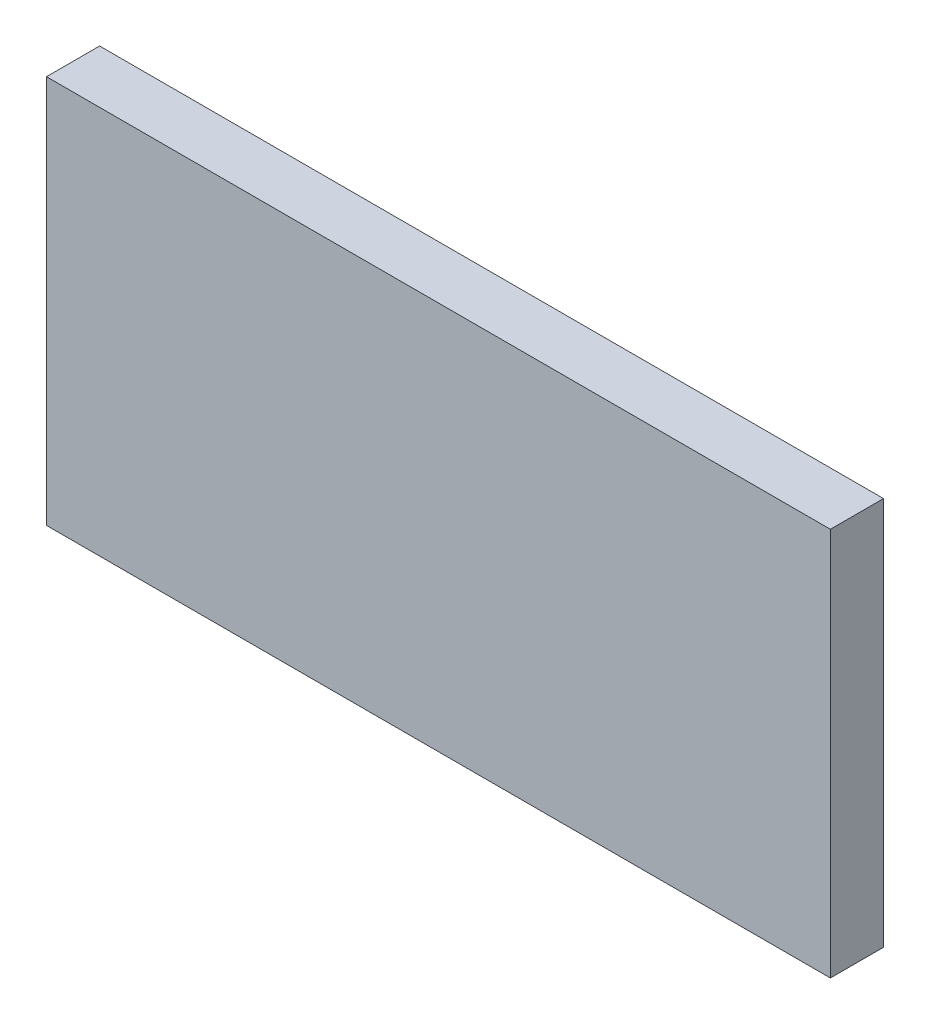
ISO-10303-21;
HEADER;
FILE_DESCRIPTION(('STEP AP214'),'2;1');
FILE_NAME('part.step','',(''),(''),'','','');
FILE_SCHEMA(('AUTOMOTIVE_DESIGN { 1 0 10303 214 1 1 1 1 }'));
ENDSEC;
DATA;
#1=APPLICATION_CONTEXT('core data for automotive mechanical design processes');
#2=APPLICATION_PROTOCOL_DEFINITION('international standard','automotive_design',2000,#1);
#3=PRODUCT_CONTEXT('',#1,'mechanical');
#4=PRODUCT('Part','Part','',(#3));
#5=PRODUCT_RELATED_PRODUCT_CATEGORY('part','',(#4));
#6=PRODUCT_DEFINITION_FORMATION('','',#4);
#7=PRODUCT_DEFINITION_CONTEXT('part definition',#1,'design');
#8=PRODUCT_DEFINITION('design','',#6,#7);
#9=PRODUCT_DEFINITION_SHAPE('','',#8);
#10=(LENGTH_UNIT() NAMED_UNIT(*) SI_UNIT(.MILLI.,.METRE.));
#11=(NAMED_UNIT(*) PLANE_ANGLE_UNIT() SI_UNIT($,.RADIAN.));
#12=(NAMED_UNIT(*) SI_UNIT($,.STERADIAN.) SOLID_ANGLE_UNIT());
#13=UNCERTAINTY_MEASURE_WITH_UNIT(LENGTH_MEASURE(1.E-05),#10,'distance_accuracy_value','');
#14=(GEOMETRIC_REPRESENTATION_CONTEXT(3) GLOBAL_UNCERTAINTY_ASSIGNED_CONTEXT((#13)) GLOBAL_UNIT_ASSIGNED_CONTEXT((#10,
#11,#12)) REPRESENTATION_CONTEXT('',''));
#15=CARTESIAN_POINT('',(0.,0.,0.));
#16=DIRECTION('',(0.,0.,1.));
#17=DIRECTION('',(1.,0.,0.));
#18=AXIS2_PLACEMENT_3D('',#15,#16,#17);
#19=CARTESIAN_POINT('',(0.,0.,4.064));
#20=DIRECTION('',(1.,0.,0.));
#21=DIRECTION('',(0.,0.,-1.));
#22=AXIS2_PLACEMENT_3D('',#19,#20,#21);
#23=PLANE('',#22);
#24=DIRECTION('',(0.,-1.,0.));
#25=VECTOR('',#24,1.);
#26=CARTESIAN_POINT('',(0.,0.,0.));
#27=LINE('',#26,#25);
#28=CARTESIAN_POINT('',(0.,29.718,0.));
#29=VERTEX_POINT('',#28);
#30=CARTESIAN_POINT('',(0.,0.,0.));
#31=VERTEX_POINT('',#30);
#32=EDGE_CURVE('E102',#29,#31,#27,.T.);
#33=ORIENTED_EDGE('',*,*,#32,.T.);
#34=DIRECTION('',(0.,0.,-1.));
#35=VECTOR('',#34,1.);
#36=CARTESIAN_POINT('',(0.,0.,4.064));
#37=LINE('',#36,#35);
#38=CARTESIAN_POINT('',(0.,0.,4.064));
#39=VERTEX_POINT('',#38);
#40=EDGE_CURVE('E11',#39,#31,#37,.T.);
#41=ORIENTED_EDGE('',*,*,#40,.F.);
#42=DIRECTION('',(0.,-1.,0.));
#43=VECTOR('',#42,1.);
#44=CARTESIAN_POINT('',(0.,0.,4.064));
#45=LINE('',#44,#43);
#46=CARTESIAN_POINT('',(0.,29.718,4.064));
#47=VERTEX_POINT('',#46);
#48=EDGE_CURVE('E90',#47,#39,#45,.T.);
#49=ORIENTED_EDGE('',*,*,#48,.F.);
#50=DIRECTION('',(0.,0.,-1.));
#51=VECTOR('',#50,1.);
#52=CARTESIAN_POINT('',(0.,29.718,4.064));
#53=LINE('',#52,#51);
#54=EDGE_CURVE('E98',#47,#29,#53,.T.);
#55=ORIENTED_EDGE('',*,*,#54,.T.);
#56=EDGE_LOOP('',(#33,#41,#49,#55));
#57=FACE_BOUND('',#56,.T.);
#58=ADVANCED_FACE('F39',(#57),#23,.F.);
#59=CARTESIAN_POINT('',(0.,0.,4.064));
#60=DIRECTION('',(0.,1.,0.));
#61=DIRECTION('',(0.,0.,1.));
#62=AXIS2_PLACEMENT_3D('',#59,#60,#61);
#63=PLANE('',#62);
#64=DIRECTION('',(1.,0.,0.));
#65=VECTOR('',#64,1.);
#66=CARTESIAN_POINT('',(0.,0.,0.));
#67=LINE('',#66,#65);
#68=CARTESIAN_POINT('',(59.944,0.,0.));
#69=VERTEX_POINT('',#68);
#70=EDGE_CURVE('E94',#31,#69,#67,.T.);
#71=ORIENTED_EDGE('',*,*,#70,.T.);
#72=DIRECTION('',(0.,0.,-1.));
#73=VECTOR('',#72,1.);
#74=CARTESIAN_POINT('',(59.944,0.,4.064));
#75=LINE('',#74,#73);
#76=CARTESIAN_POINT('',(59.944,0.,4.064));
#77=VERTEX_POINT('',#76);
#78=EDGE_CURVE('E47',#77,#69,#75,.T.);
#79=ORIENTED_EDGE('',*,*,#78,.F.);
#80=DIRECTION('',(1.,0.,0.));
#81=VECTOR('',#80,1.);
#82=CARTESIAN_POINT('',(0.,0.,4.064));
#83=LINE('',#82,#81);
#84=EDGE_CURVE('E85',#39,#77,#83,.T.);
#85=ORIENTED_EDGE('',*,*,#84,.F.);
#86=ORIENTED_EDGE('',*,*,#40,.T.);
#87=EDGE_LOOP('',(#71,#79,#85,#86));
#88=FACE_BOUND('',#87,.T.);
#89=ADVANCED_FACE('F93',(#88),#63,.F.);
#90=CARTESIAN_POINT('',(59.944,0.,4.064));
#91=DIRECTION('',(-1.,0.,0.));
#92=DIRECTION('',(0.,0.,1.));
#93=AXIS2_PLACEMENT_3D('',#90,#91,#92);
#94=PLANE('',#93);
#95=DIRECTION('',(0.,1.,0.));
#96=VECTOR('',#95,1.);
#97=CARTESIAN_POINT('',(59.944,0.,0.));
#98=LINE('',#97,#96);
#99=CARTESIAN_POINT('',(59.944,29.718,0.));
#100=VERTEX_POINT('',#99);
#101=EDGE_CURVE('E72',#69,#100,#98,.T.);
#102=ORIENTED_EDGE('',*,*,#101,.T.);
#103=DIRECTION('',(0.,0.,-1.));
#104=VECTOR('',#103,1.);
#105=CARTESIAN_POINT('',(59.944,29.718,4.064));
#106=LINE('',#105,#104);
#107=CARTESIAN_POINT('',(59.944,29.718,4.064));
#108=VERTEX_POINT('',#107);
#109=EDGE_CURVE('E95',#108,#100,#106,.T.);
#110=ORIENTED_EDGE('',*,*,#109,.F.);
#111=DIRECTION('',(0.,1.,0.));
#112=VECTOR('',#111,1.);
#113=CARTESIAN_POINT('',(59.944,0.,4.064));
#114=LINE('',#113,#112);
#115=EDGE_CURVE('E88',#77,#108,#114,.T.);
#116=ORIENTED_EDGE('',*,*,#115,.F.);
#117=ORIENTED_EDGE('',*,*,#78,.T.);
#118=EDGE_LOOP('',(#102,#110,#116,#117));
#119=FACE_BOUND('',#118,.T.);
#120=ADVANCED_FACE('F96',(#119),#94,.F.);
#121=CARTESIAN_POINT('',(0.,29.718,4.064));
#122=DIRECTION('',(0.,-1.,0.));
#123=DIRECTION('',(0.,0.,-1.));
#124=AXIS2_PLACEMENT_3D('',#121,#122,#123);
#125=PLANE('',#124);
#126=DIRECTION('',(-1.,0.,0.));
#127=VECTOR('',#126,1.);
#128=CARTESIAN_POINT('',(0.,29.718,0.));
#129=LINE('',#128,#127);
#130=EDGE_CURVE('E78',#100,#29,#129,.T.);
#131=ORIENTED_EDGE('',*,*,#130,.T.);
#132=ORIENTED_EDGE('',*,*,#54,.F.);
#133=DIRECTION('',(-1.,0.,0.));
#134=VECTOR('',#133,1.);
#135=CARTESIAN_POINT('',(0.,29.718,4.064));
#136=LINE('',#135,#134);
#137=EDGE_CURVE('E55',#108,#47,#136,.T.);
#138=ORIENTED_EDGE('',*,*,#137,.F.);
#139=ORIENTED_EDGE('',*,*,#109,.T.);
#140=EDGE_LOOP('',(#131,#132,#138,#139));
#141=FACE_BOUND('',#140,.T.);
#142=ADVANCED_FACE('F109',(#141),#125,.F.);
#143=CARTESIAN_POINT('',(0.,0.,4.064));
#144=DIRECTION('',(0.,0.,-1.));
#145=DIRECTION('',(-1.,0.,0.));
#146=AXIS2_PLACEMENT_3D('',#143,#144,#145);
#147=PLANE('',#146);
#148=ORIENTED_EDGE('',*,*,#48,.T.);
#149=ORIENTED_EDGE('',*,*,#84,.T.);
#150=ORIENTED_EDGE('',*,*,#115,.T.);
#151=ORIENTED_EDGE('',*,*,#137,.T.);
#152=EDGE_LOOP('',(#148,#149,#150,#151));
#153=FACE_BOUND('',#152,.T.);
#154=ADVANCED_FACE('F86',(#153),#147,.F.);
#155=CARTESIAN_POINT('',(0.,0.,0.));
#156=DIRECTION('',(0.,0.,-1.));
#157=DIRECTION('',(-1.,0.,0.));
#158=AXIS2_PLACEMENT_3D('',#155,#156,#157);
#159=PLANE('',#158);
#160=ORIENTED_EDGE('',*,*,#32,.F.);
#161=ORIENTED_EDGE('',*,*,#130,.F.);
#162=ORIENTED_EDGE('',*,*,#101,.F.);
#163=ORIENTED_EDGE('',*,*,#70,.F.);
#164=EDGE_LOOP('',(#160,#161,#162,#163));
#165=FACE_BOUND('',#164,.T.);
#166=ADVANCED_FACE('F112',(#165),#159,.T.);
#167=CLOSED_SHELL('',(#58,#89,#120,#142,#154,#166));
#168=MANIFOLD_SOLID_BREP('B2',#167);
#169=ADVANCED_BREP_SHAPE_REPRESENTATION('',(#18,#168),#14);
#170=SHAPE_DEFINITION_REPRESENTATION(#9,#169);
ENDSEC;
END-ISO-10303-21;
